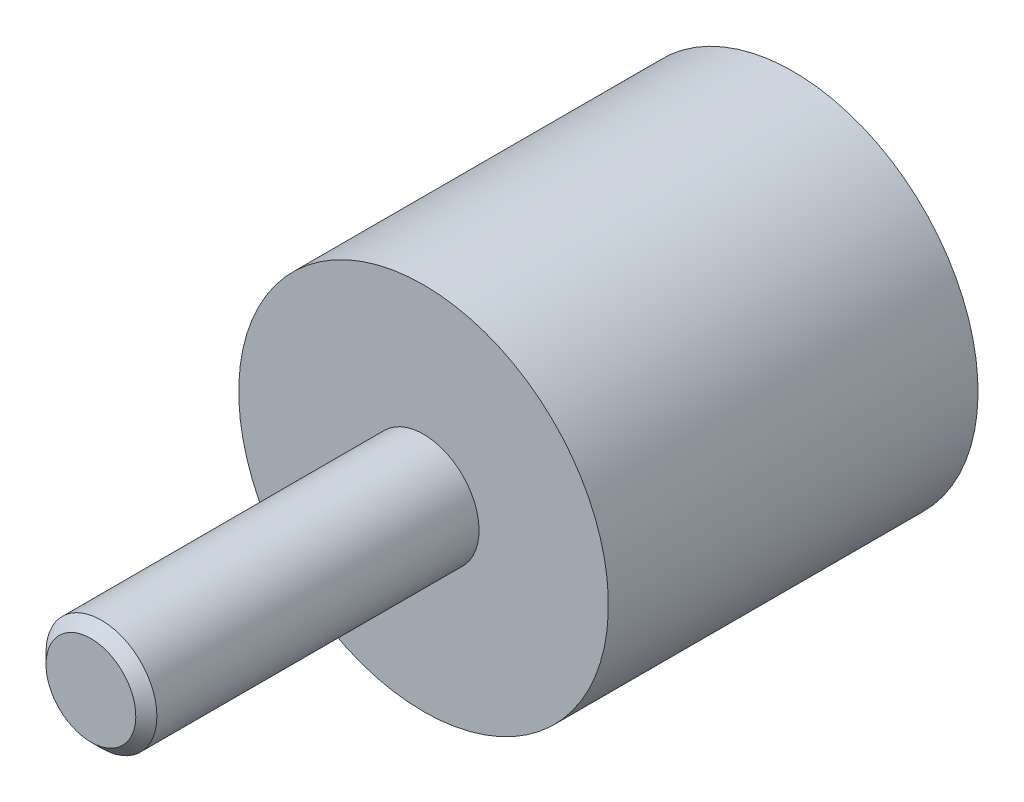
ISO-10303-21;
HEADER;
FILE_DESCRIPTION(('STEP AP214'),'2;1');
FILE_NAME('part.step','',(''),(''),'','','');
FILE_SCHEMA(('AUTOMOTIVE_DESIGN { 1 0 10303 214 1 1 1 1 }'));
ENDSEC;
DATA;
#1=APPLICATION_CONTEXT('core data for automotive mechanical design processes');
#2=APPLICATION_PROTOCOL_DEFINITION('international standard','automotive_design',2000,#1);
#3=PRODUCT_CONTEXT('',#1,'mechanical');
#4=PRODUCT('Part','Part','',(#3));
#5=PRODUCT_RELATED_PRODUCT_CATEGORY('part','',(#4));
#6=PRODUCT_DEFINITION_FORMATION('','',#4);
#7=PRODUCT_DEFINITION_CONTEXT('part definition',#1,'design');
#8=PRODUCT_DEFINITION('design','',#6,#7);
#9=PRODUCT_DEFINITION_SHAPE('','',#8);
#10=(LENGTH_UNIT() NAMED_UNIT(*) SI_UNIT(.MILLI.,.METRE.));
#11=(NAMED_UNIT(*) PLANE_ANGLE_UNIT() SI_UNIT($,.RADIAN.));
#12=(NAMED_UNIT(*) SI_UNIT($,.STERADIAN.) SOLID_ANGLE_UNIT());
#13=UNCERTAINTY_MEASURE_WITH_UNIT(LENGTH_MEASURE(1.E-05),#10,'distance_accuracy_value','');
#14=(GEOMETRIC_REPRESENTATION_CONTEXT(3) GLOBAL_UNCERTAINTY_ASSIGNED_CONTEXT((#13)) GLOBAL_UNIT_ASSIGNED_CONTEXT((#10,
#11,#12)) REPRESENTATION_CONTEXT('',''));
#15=CARTESIAN_POINT('',(0.,0.,0.));
#16=DIRECTION('',(0.,0.,1.));
#17=DIRECTION('',(1.,0.,0.));
#18=AXIS2_PLACEMENT_3D('',#15,#16,#17);
#19=CARTESIAN_POINT('',(0.,0.,0.));
#20=DIRECTION('',(0.,0.,1.));
#21=DIRECTION('',(0.,-1.,0.));
#22=AXIS2_PLACEMENT_3D('',#19,#20,#21);
#23=CYLINDRICAL_SURFACE('',#22,10.);
#24=CARTESIAN_POINT('',(0.,0.,0.));
#25=DIRECTION('',(0.,0.,1.));
#26=DIRECTION('',(0.,-1.,0.));
#27=AXIS2_PLACEMENT_3D('',#24,#25,#26);
#28=CIRCLE('',#27,10.);
#29=CARTESIAN_POINT('',(0.,-10.,0.));
#30=VERTEX_POINT('',#29);
#31=EDGE_CURVE('E18',#30,#30,#28,.T.);
#32=ORIENTED_EDGE('',*,*,#31,.T.);
#33=EDGE_LOOP('',(#32));
#34=FACE_BOUND('',#33,.T.);
#35=CARTESIAN_POINT('',(0.,0.,20.));
#36=DIRECTION('',(0.,0.,-1.));
#37=DIRECTION('',(0.,1.,0.));
#38=AXIS2_PLACEMENT_3D('',#35,#36,#37);
#39=CIRCLE('',#38,10.);
#40=CARTESIAN_POINT('',(0.,10.,20.));
#41=VERTEX_POINT('',#40);
#42=EDGE_CURVE('E22',#41,#41,#39,.T.);
#43=ORIENTED_EDGE('',*,*,#42,.T.);
#44=EDGE_LOOP('',(#43));
#45=FACE_BOUND('',#44,.T.);
#46=ADVANCED_FACE('F12',(#34,#45),#23,.T.);
#47=CARTESIAN_POINT('',(10.,0.,0.));
#48=DIRECTION('',(0.,0.,-1.));
#49=DIRECTION('',(0.,1.,0.));
#50=AXIS2_PLACEMENT_3D('',#47,#48,#49);
#51=PLANE('',#50);
#52=ORIENTED_EDGE('',*,*,#31,.F.);
#53=EDGE_LOOP('',(#52));
#54=FACE_BOUND('',#53,.T.);
#55=ADVANCED_FACE('F48',(#54),#51,.T.);
#56=CARTESIAN_POINT('',(10.,0.,20.));
#57=DIRECTION('',(0.,0.,1.));
#58=DIRECTION('',(0.,-1.,0.));
#59=AXIS2_PLACEMENT_3D('',#56,#57,#58);
#60=PLANE('',#59);
#61=CARTESIAN_POINT('',(0.,0.,20.));
#62=DIRECTION('',(0.,0.,1.));
#63=DIRECTION('',(0.,-1.,0.));
#64=AXIS2_PLACEMENT_3D('',#61,#62,#63);
#65=CIRCLE('',#64,3.);
#66=CARTESIAN_POINT('',(0.,-3.,20.));
#67=VERTEX_POINT('',#66);
#68=EDGE_CURVE('E8',#67,#67,#65,.F.);
#69=ORIENTED_EDGE('',*,*,#68,.T.);
#70=EDGE_LOOP('',(#69));
#71=FACE_BOUND('',#70,.T.);
#72=ORIENTED_EDGE('',*,*,#42,.F.);
#73=EDGE_LOOP('',(#72));
#74=FACE_BOUND('',#73,.T.);
#75=ADVANCED_FACE('F52',(#71,#74),#60,.T.);
#76=CARTESIAN_POINT('',(0.,0.,10.));
#77=DIRECTION('',(0.,0.,1.));
#78=DIRECTION('',(0.,-1.,0.));
#79=AXIS2_PLACEMENT_3D('',#76,#77,#78);
#80=CYLINDRICAL_SURFACE('',#79,3.);
#81=ORIENTED_EDGE('',*,*,#68,.F.);
#82=EDGE_LOOP('',(#81));
#83=FACE_BOUND('',#82,.T.);
#84=CARTESIAN_POINT('',(0.,0.,37.4293600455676));
#85=DIRECTION('',(0.,0.,-1.));
#86=DIRECTION('',(0.,1.,0.));
#87=AXIS2_PLACEMENT_3D('',#84,#85,#86);
#88=CIRCLE('',#87,3.);
#89=CARTESIAN_POINT('',(0.,3.,37.4293600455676));
#90=VERTEX_POINT('',#89);
#91=EDGE_CURVE('E26',#90,#90,#88,.T.);
#92=ORIENTED_EDGE('',*,*,#91,.T.);
#93=EDGE_LOOP('',(#92));
#94=FACE_BOUND('',#93,.T.);
#95=ADVANCED_FACE('F45',(#83,#94),#80,.T.);
#96=CARTESIAN_POINT('',(0.,0.,37.4293600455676));
#97=DIRECTION('',(0.,0.,-1.));
#98=DIRECTION('',(0.,1.,0.));
#99=AXIS2_PLACEMENT_3D('',#96,#97,#98);
#100=CONICAL_SURFACE('',#99,3.,0.785398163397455);
#101=CARTESIAN_POINT('',(0.,0.,38.));
#102=DIRECTION('',(0.,0.,-1.));
#103=DIRECTION('',(0.,1.,0.));
#104=AXIS2_PLACEMENT_3D('',#101,#102,#103);
#105=CIRCLE('',#104,2.42936004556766);
#106=CARTESIAN_POINT('',(0.,2.42936004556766,38.));
#107=VERTEX_POINT('',#106);
#108=EDGE_CURVE('E31',#107,#107,#105,.T.);
#109=ORIENTED_EDGE('',*,*,#108,.T.);
#110=EDGE_LOOP('',(#109));
#111=FACE_BOUND('',#110,.T.);
#112=ORIENTED_EDGE('',*,*,#91,.F.);
#113=EDGE_LOOP('',(#112));
#114=FACE_BOUND('',#113,.T.);
#115=ADVANCED_FACE('F35',(#111,#114),#100,.T.);
#116=CARTESIAN_POINT('',(2.42936004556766,0.,38.));
#117=DIRECTION('',(0.,0.,1.));
#118=DIRECTION('',(0.,-1.,0.));
#119=AXIS2_PLACEMENT_3D('',#116,#117,#118);
#120=PLANE('',#119);
#121=ORIENTED_EDGE('',*,*,#108,.F.);
#122=EDGE_LOOP('',(#121));
#123=FACE_BOUND('',#122,.T.);
#124=ADVANCED_FACE('F38',(#123),#120,.T.);
#125=CLOSED_SHELL('',(#46,#55,#75,#95,#115,#124));
#126=MANIFOLD_SOLID_BREP('B1',#125);
#127=ADVANCED_BREP_SHAPE_REPRESENTATION('',(#18,#126),#14);
#128=SHAPE_DEFINITION_REPRESENTATION(#9,#127);
ENDSEC;
END-ISO-10303-21;
